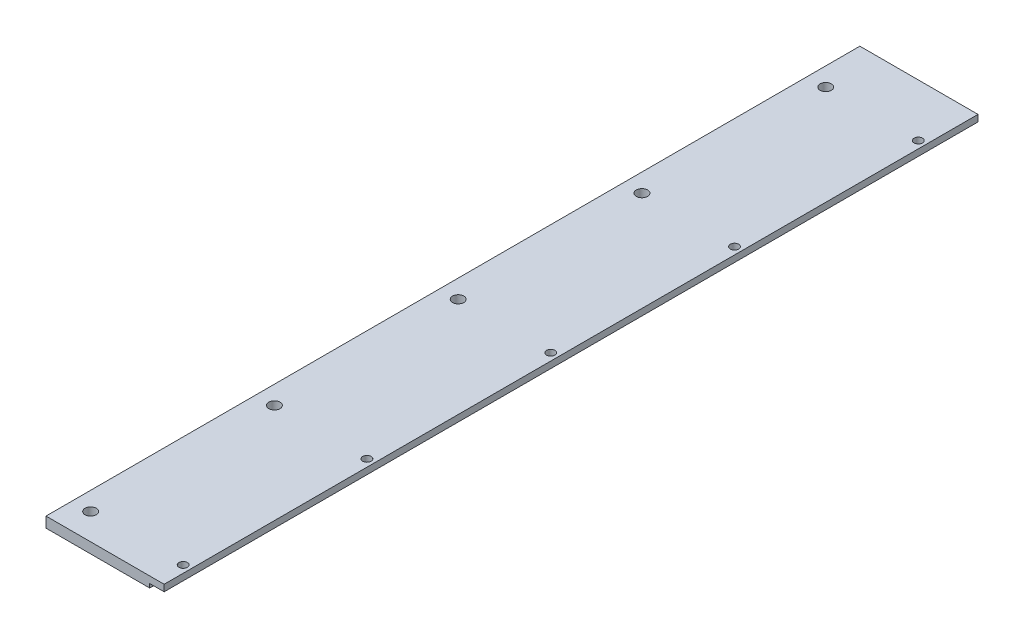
ISO-10303-21;
HEADER;
FILE_DESCRIPTION(('STEP AP214'),'2;1');
FILE_NAME('part.step','',(''),(''),'','','');
FILE_SCHEMA(('AUTOMOTIVE_DESIGN { 1 0 10303 214 1 1 1 1 }'));
ENDSEC;
DATA;
#1=APPLICATION_CONTEXT('core data for automotive mechanical design processes');
#2=APPLICATION_PROTOCOL_DEFINITION('international standard','automotive_design',2000,#1);
#3=PRODUCT_CONTEXT('',#1,'mechanical');
#4=PRODUCT('Part','Part','',(#3));
#5=PRODUCT_RELATED_PRODUCT_CATEGORY('part','',(#4));
#6=PRODUCT_DEFINITION_FORMATION('','',#4);
#7=PRODUCT_DEFINITION_CONTEXT('part definition',#1,'design');
#8=PRODUCT_DEFINITION('design','',#6,#7);
#9=PRODUCT_DEFINITION_SHAPE('','',#8);
#10=(LENGTH_UNIT() NAMED_UNIT(*) SI_UNIT(.MILLI.,.METRE.));
#11=(NAMED_UNIT(*) PLANE_ANGLE_UNIT() SI_UNIT($,.RADIAN.));
#12=(NAMED_UNIT(*) SI_UNIT($,.STERADIAN.) SOLID_ANGLE_UNIT());
#13=UNCERTAINTY_MEASURE_WITH_UNIT(LENGTH_MEASURE(1.E-05),#10,'distance_accuracy_value','');
#14=(GEOMETRIC_REPRESENTATION_CONTEXT(3) GLOBAL_UNCERTAINTY_ASSIGNED_CONTEXT((#13)) GLOBAL_UNIT_ASSIGNED_CONTEXT((#10,
#11,#12)) REPRESENTATION_CONTEXT('',''));
#15=CARTESIAN_POINT('',(0.,0.,0.));
#16=DIRECTION('',(0.,0.,1.));
#17=DIRECTION('',(1.,0.,0.));
#18=AXIS2_PLACEMENT_3D('',#15,#16,#17);
#19=CARTESIAN_POINT('',(0.,0.,310.));
#20=DIRECTION('',(1.,0.,0.));
#21=DIRECTION('',(0.,0.,-1.));
#22=AXIS2_PLACEMENT_3D('',#19,#20,#21);
#23=PLANE('',#22);
#24=DIRECTION('',(0.,-1.,0.));
#25=VECTOR('',#24,1.);
#26=CARTESIAN_POINT('',(0.,0.,0.));
#27=LINE('',#26,#25);
#28=CARTESIAN_POINT('',(0.,4.,0.));
#29=VERTEX_POINT('',#28);
#30=CARTESIAN_POINT('',(0.,0.,0.));
#31=VERTEX_POINT('',#30);
#32=EDGE_CURVE('E406',#29,#31,#27,.T.);
#33=ORIENTED_EDGE('',*,*,#32,.T.);
#34=DIRECTION('',(0.,0.,-1.));
#35=VECTOR('',#34,1.);
#36=CARTESIAN_POINT('',(0.,0.,310.));
#37=LINE('',#36,#35);
#38=CARTESIAN_POINT('',(0.,0.,310.));
#39=VERTEX_POINT('',#38);
#40=EDGE_CURVE('E11',#39,#31,#37,.T.);
#41=ORIENTED_EDGE('',*,*,#40,.F.);
#42=DIRECTION('',(0.,-1.,0.));
#43=VECTOR('',#42,1.);
#44=CARTESIAN_POINT('',(0.,0.,310.));
#45=LINE('',#44,#43);
#46=CARTESIAN_POINT('',(0.,4.,310.));
#47=VERTEX_POINT('',#46);
#48=EDGE_CURVE('E434',#47,#39,#45,.T.);
#49=ORIENTED_EDGE('',*,*,#48,.F.);
#50=DIRECTION('',(0.,0.,-1.));
#51=VECTOR('',#50,1.);
#52=CARTESIAN_POINT('',(0.,4.,310.));
#53=LINE('',#52,#51);
#54=EDGE_CURVE('E419',#47,#29,#53,.T.);
#55=ORIENTED_EDGE('',*,*,#54,.T.);
#56=EDGE_LOOP('',(#33,#41,#49,#55));
#57=FACE_BOUND('',#56,.T.);
#58=ADVANCED_FACE('F348',(#57),#23,.F.);
#59=CARTESIAN_POINT('',(0.,0.,310.));
#60=DIRECTION('',(0.,1.,0.));
#61=DIRECTION('',(0.,0.,1.));
#62=AXIS2_PLACEMENT_3D('',#59,#60,#61);
#63=PLANE('',#62);
#64=CARTESIAN_POINT('',(7.00000000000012,0.,20.0000000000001));
#65=DIRECTION('',(0.,1.,0.));
#66=DIRECTION('',(0.,0.,1.));
#67=AXIS2_PLACEMENT_3D('',#64,#65,#66);
#68=CIRCLE('',#67,2.15);
#69=CARTESIAN_POINT('',(7.00000000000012,0.,22.1500000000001));
#70=VERTEX_POINT('',#69);
#71=EDGE_CURVE('E485',#70,#70,#68,.T.);
#72=ORIENTED_EDGE('',*,*,#71,.T.);
#73=EDGE_LOOP('',(#72));
#74=FACE_BOUND('',#73,.T.);
#75=CARTESIAN_POINT('',(7.00000000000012,0.,90.0000000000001));
#76=DIRECTION('',(0.,1.,0.));
#77=DIRECTION('',(0.,0.,1.));
#78=AXIS2_PLACEMENT_3D('',#75,#76,#77);
#79=CIRCLE('',#78,2.15);
#80=CARTESIAN_POINT('',(7.00000000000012,0.,92.1500000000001));
#81=VERTEX_POINT('',#80);
#82=EDGE_CURVE('E491',#81,#81,#79,.T.);
#83=ORIENTED_EDGE('',*,*,#82,.T.);
#84=EDGE_LOOP('',(#83));
#85=FACE_BOUND('',#84,.T.);
#86=CARTESIAN_POINT('',(7.00000000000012,0.,160.));
#87=DIRECTION('',(0.,1.,0.));
#88=DIRECTION('',(0.,0.,1.));
#89=AXIS2_PLACEMENT_3D('',#86,#87,#88);
#90=CIRCLE('',#89,2.15);
#91=CARTESIAN_POINT('',(7.00000000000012,0.,162.15));
#92=VERTEX_POINT('',#91);
#93=EDGE_CURVE('E497',#92,#92,#90,.T.);
#94=ORIENTED_EDGE('',*,*,#93,.T.);
#95=EDGE_LOOP('',(#94));
#96=FACE_BOUND('',#95,.T.);
#97=CARTESIAN_POINT('',(7.00000000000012,0.,230.));
#98=DIRECTION('',(0.,1.,0.));
#99=DIRECTION('',(0.,0.,1.));
#100=AXIS2_PLACEMENT_3D('',#97,#98,#99);
#101=CIRCLE('',#100,2.15);
#102=CARTESIAN_POINT('',(7.00000000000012,0.,232.15));
#103=VERTEX_POINT('',#102);
#104=EDGE_CURVE('E503',#103,#103,#101,.T.);
#105=ORIENTED_EDGE('',*,*,#104,.T.);
#106=EDGE_LOOP('',(#105));
#107=FACE_BOUND('',#106,.T.);
#108=CARTESIAN_POINT('',(7.00000000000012,0.,300.));
#109=DIRECTION('',(0.,1.,0.));
#110=DIRECTION('',(0.,0.,1.));
#111=AXIS2_PLACEMENT_3D('',#108,#109,#110);
#112=CIRCLE('',#111,2.15);
#113=CARTESIAN_POINT('',(7.00000000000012,0.,302.15));
#114=VERTEX_POINT('',#113);
#115=EDGE_CURVE('E420',#114,#114,#112,.T.);
#116=ORIENTED_EDGE('',*,*,#115,.T.);
#117=EDGE_LOOP('',(#116));
#118=FACE_BOUND('',#117,.T.);
#119=DIRECTION('',(1.,0.,0.));
#120=VECTOR('',#119,1.);
#121=CARTESIAN_POINT('',(0.,0.,0.));
#122=LINE('',#121,#120);
#123=CARTESIAN_POINT('',(39.5,0.,0.));
#124=VERTEX_POINT('',#123);
#125=EDGE_CURVE('E402',#31,#124,#122,.T.);
#126=ORIENTED_EDGE('',*,*,#125,.T.);
#127=DIRECTION('',(0.,0.,-1.));
#128=VECTOR('',#127,1.);
#129=CARTESIAN_POINT('',(39.5,0.,310.));
#130=LINE('',#129,#128);
#131=CARTESIAN_POINT('',(39.5,0.,310.));
#132=VERTEX_POINT('',#131);
#133=EDGE_CURVE('E356',#132,#124,#130,.T.);
#134=ORIENTED_EDGE('',*,*,#133,.F.);
#135=DIRECTION('',(1.,0.,0.));
#136=VECTOR('',#135,1.);
#137=CARTESIAN_POINT('',(0.,0.,310.));
#138=LINE('',#137,#136);
#139=EDGE_CURVE('E415',#39,#132,#138,.T.);
#140=ORIENTED_EDGE('',*,*,#139,.F.);
#141=ORIENTED_EDGE('',*,*,#40,.T.);
#142=EDGE_LOOP('',(#126,#134,#140,#141));
#143=FACE_BOUND('',#142,.T.);
#144=ADVANCED_FACE('F414',(#74,#85,#96,#107,#118,#143),#63,.F.);
#145=CARTESIAN_POINT('',(39.5,1.5,310.));
#146=DIRECTION('',(-1.,0.,0.));
#147=DIRECTION('',(0.,-1.,0.));
#148=AXIS2_PLACEMENT_3D('',#145,#146,#147);
#149=PLANE('',#148);
#150=DIRECTION('',(0.,1.,0.));
#151=VECTOR('',#150,1.);
#152=CARTESIAN_POINT('',(39.5,1.5,0.));
#153=LINE('',#152,#151);
#154=CARTESIAN_POINT('',(39.5,1.5,0.));
#155=VERTEX_POINT('',#154);
#156=EDGE_CURVE('E408',#124,#155,#153,.T.);
#157=ORIENTED_EDGE('',*,*,#156,.T.);
#158=DIRECTION('',(0.,0.,-1.));
#159=VECTOR('',#158,1.);
#160=CARTESIAN_POINT('',(39.5,1.5,310.));
#161=LINE('',#160,#159);
#162=CARTESIAN_POINT('',(39.5,1.5,310.));
#163=VERTEX_POINT('',#162);
#164=EDGE_CURVE('E450',#163,#155,#161,.T.);
#165=ORIENTED_EDGE('',*,*,#164,.F.);
#166=DIRECTION('',(0.,1.,0.));
#167=VECTOR('',#166,1.);
#168=CARTESIAN_POINT('',(39.5,1.5,310.));
#169=LINE('',#168,#167);
#170=EDGE_CURVE('E437',#132,#163,#169,.T.);
#171=ORIENTED_EDGE('',*,*,#170,.F.);
#172=ORIENTED_EDGE('',*,*,#133,.T.);
#173=EDGE_LOOP('',(#157,#165,#171,#172));
#174=FACE_BOUND('',#173,.T.);
#175=ADVANCED_FACE('F528',(#174),#149,.F.);
#176=CARTESIAN_POINT('',(39.5,1.5,310.));
#177=DIRECTION('',(0.,1.,0.));
#178=DIRECTION('',(0.,0.,1.));
#179=AXIS2_PLACEMENT_3D('',#176,#177,#178);
#180=PLANE('',#179);
#181=CARTESIAN_POINT('',(42.25,1.5,20.0000000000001));
#182=DIRECTION('',(0.,1.,0.));
#183=DIRECTION('',(0.,0.,1.));
#184=AXIS2_PLACEMENT_3D('',#181,#182,#183);
#185=CIRCLE('',#184,1.59999999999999);
#186=CARTESIAN_POINT('',(42.25,1.5,21.6000000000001));
#187=VERTEX_POINT('',#186);
#188=EDGE_CURVE('E351',#187,#187,#185,.T.);
#189=ORIENTED_EDGE('',*,*,#188,.T.);
#190=EDGE_LOOP('',(#189));
#191=FACE_BOUND('',#190,.T.);
#192=CARTESIAN_POINT('',(42.25,1.5,90.0000000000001));
#193=DIRECTION('',(0.,1.,0.));
#194=DIRECTION('',(0.,0.,1.));
#195=AXIS2_PLACEMENT_3D('',#192,#193,#194);
#196=CIRCLE('',#195,1.59999999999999);
#197=CARTESIAN_POINT('',(42.25,1.5,91.6000000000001));
#198=VERTEX_POINT('',#197);
#199=EDGE_CURVE('E466',#198,#198,#196,.T.);
#200=ORIENTED_EDGE('',*,*,#199,.T.);
#201=EDGE_LOOP('',(#200));
#202=FACE_BOUND('',#201,.T.);
#203=CARTESIAN_POINT('',(42.25,1.5,160.));
#204=DIRECTION('',(0.,1.,0.));
#205=DIRECTION('',(0.,0.,1.));
#206=AXIS2_PLACEMENT_3D('',#203,#204,#205);
#207=CIRCLE('',#206,1.59999999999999);
#208=CARTESIAN_POINT('',(42.25,1.5,161.6));
#209=VERTEX_POINT('',#208);
#210=EDGE_CURVE('E463',#209,#209,#207,.T.);
#211=ORIENTED_EDGE('',*,*,#210,.T.);
#212=EDGE_LOOP('',(#211));
#213=FACE_BOUND('',#212,.T.);
#214=CARTESIAN_POINT('',(42.25,1.5,230.));
#215=DIRECTION('',(0.,1.,0.));
#216=DIRECTION('',(0.,0.,1.));
#217=AXIS2_PLACEMENT_3D('',#214,#215,#216);
#218=CIRCLE('',#217,1.59999999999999);
#219=CARTESIAN_POINT('',(42.25,1.5,231.6));
#220=VERTEX_POINT('',#219);
#221=EDGE_CURVE('E458',#220,#220,#218,.T.);
#222=ORIENTED_EDGE('',*,*,#221,.T.);
#223=EDGE_LOOP('',(#222));
#224=FACE_BOUND('',#223,.T.);
#225=CARTESIAN_POINT('',(42.25,1.5,300.));
#226=DIRECTION('',(0.,1.,0.));
#227=DIRECTION('',(0.,0.,1.));
#228=AXIS2_PLACEMENT_3D('',#225,#226,#227);
#229=CIRCLE('',#228,1.59999999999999);
#230=CARTESIAN_POINT('',(42.25,1.5,301.6));
#231=VERTEX_POINT('',#230);
#232=EDGE_CURVE('E454',#231,#231,#229,.T.);
#233=ORIENTED_EDGE('',*,*,#232,.T.);
#234=EDGE_LOOP('',(#233));
#235=FACE_BOUND('',#234,.T.);
#236=DIRECTION('',(1.,0.,0.));
#237=VECTOR('',#236,1.);
#238=CARTESIAN_POINT('',(39.5,1.5,0.));
#239=LINE('',#238,#237);
#240=CARTESIAN_POINT('',(45.,1.5,0.));
#241=VERTEX_POINT('',#240);
#242=EDGE_CURVE('E428',#155,#241,#239,.T.);
#243=ORIENTED_EDGE('',*,*,#242,.T.);
#244=DIRECTION('',(0.,0.,-1.));
#245=VECTOR('',#244,1.);
#246=CARTESIAN_POINT('',(45.,1.5,310.));
#247=LINE('',#246,#245);
#248=CARTESIAN_POINT('',(45.,1.5,310.));
#249=VERTEX_POINT('',#248);
#250=EDGE_CURVE('E447',#249,#241,#247,.T.);
#251=ORIENTED_EDGE('',*,*,#250,.F.);
#252=DIRECTION('',(1.,0.,0.));
#253=VECTOR('',#252,1.);
#254=CARTESIAN_POINT('',(39.5,1.5,310.));
#255=LINE('',#254,#253);
#256=EDGE_CURVE('E439',#163,#249,#255,.T.);
#257=ORIENTED_EDGE('',*,*,#256,.F.);
#258=ORIENTED_EDGE('',*,*,#164,.T.);
#259=EDGE_LOOP('',(#243,#251,#257,#258));
#260=FACE_BOUND('',#259,.T.);
#261=ADVANCED_FACE('F524',(#191,#202,#213,#224,#235,#260),#180,.F.);
#262=CARTESIAN_POINT('',(45.,1.5,310.));
#263=DIRECTION('',(-1.,0.,0.));
#264=DIRECTION('',(0.,0.,1.));
#265=AXIS2_PLACEMENT_3D('',#262,#263,#264);
#266=PLANE('',#265);
#267=DIRECTION('',(0.,1.,0.));
#268=VECTOR('',#267,1.);
#269=CARTESIAN_POINT('',(45.,1.5,0.));
#270=LINE('',#269,#268);
#271=CARTESIAN_POINT('',(45.,4.,0.));
#272=VERTEX_POINT('',#271);
#273=EDGE_CURVE('E430',#241,#272,#270,.T.);
#274=ORIENTED_EDGE('',*,*,#273,.T.);
#275=DIRECTION('',(0.,0.,-1.));
#276=VECTOR('',#275,1.);
#277=CARTESIAN_POINT('',(45.,4.,310.));
#278=LINE('',#277,#276);
#279=CARTESIAN_POINT('',(45.,4.,310.));
#280=VERTEX_POINT('',#279);
#281=EDGE_CURVE('E444',#280,#272,#278,.T.);
#282=ORIENTED_EDGE('',*,*,#281,.F.);
#283=DIRECTION('',(0.,1.,0.));
#284=VECTOR('',#283,1.);
#285=CARTESIAN_POINT('',(45.,1.5,310.));
#286=LINE('',#285,#284);
#287=EDGE_CURVE('E369',#249,#280,#286,.T.);
#288=ORIENTED_EDGE('',*,*,#287,.F.);
#289=ORIENTED_EDGE('',*,*,#250,.T.);
#290=EDGE_LOOP('',(#274,#282,#288,#289));
#291=FACE_BOUND('',#290,.T.);
#292=ADVANCED_FACE('F516',(#291),#266,.F.);
#293=CARTESIAN_POINT('',(0.,4.,310.));
#294=DIRECTION('',(0.,-1.,0.));
#295=DIRECTION('',(0.,0.,-1.));
#296=AXIS2_PLACEMENT_3D('',#293,#294,#295);
#297=PLANE('',#296);
#298=CARTESIAN_POINT('',(42.25,4.,20.0000000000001));
#299=DIRECTION('',(0.,1.,0.));
#300=DIRECTION('',(0.,0.,1.));
#301=AXIS2_PLACEMENT_3D('',#298,#299,#300);
#302=CIRCLE('',#301,1.59999999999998);
#303=CARTESIAN_POINT('',(42.25,4.,21.6000000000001));
#304=VERTEX_POINT('',#303);
#305=EDGE_CURVE('E478',#304,#304,#302,.T.);
#306=ORIENTED_EDGE('',*,*,#305,.F.);
#307=EDGE_LOOP('',(#306));
#308=FACE_BOUND('',#307,.T.);
#309=CARTESIAN_POINT('',(42.25,4.,90.0000000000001));
#310=DIRECTION('',(0.,1.,0.));
#311=DIRECTION('',(0.,0.,1.));
#312=AXIS2_PLACEMENT_3D('',#309,#310,#311);
#313=CIRCLE('',#312,1.59999999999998);
#314=CARTESIAN_POINT('',(42.25,4.,91.6000000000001));
#315=VERTEX_POINT('',#314);
#316=EDGE_CURVE('E468',#315,#315,#313,.T.);
#317=ORIENTED_EDGE('',*,*,#316,.F.);
#318=EDGE_LOOP('',(#317));
#319=FACE_BOUND('',#318,.T.);
#320=CARTESIAN_POINT('',(42.25,4.,160.));
#321=DIRECTION('',(0.,1.,0.));
#322=DIRECTION('',(0.,0.,1.));
#323=AXIS2_PLACEMENT_3D('',#320,#321,#322);
#324=CIRCLE('',#323,1.59999999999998);
#325=CARTESIAN_POINT('',(42.25,4.,161.6));
#326=VERTEX_POINT('',#325);
#327=EDGE_CURVE('E465',#326,#326,#324,.T.);
#328=ORIENTED_EDGE('',*,*,#327,.F.);
#329=EDGE_LOOP('',(#328));
#330=FACE_BOUND('',#329,.T.);
#331=CARTESIAN_POINT('',(42.25,4.,230.));
#332=DIRECTION('',(0.,1.,0.));
#333=DIRECTION('',(0.,0.,1.));
#334=AXIS2_PLACEMENT_3D('',#331,#332,#333);
#335=CIRCLE('',#334,1.59999999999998);
#336=CARTESIAN_POINT('',(42.25,4.,231.6));
#337=VERTEX_POINT('',#336);
#338=EDGE_CURVE('E462',#337,#337,#335,.T.);
#339=ORIENTED_EDGE('',*,*,#338,.F.);
#340=EDGE_LOOP('',(#339));
#341=FACE_BOUND('',#340,.T.);
#342=CARTESIAN_POINT('',(7.00000000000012,4.,20.0000000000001));
#343=DIRECTION('',(0.,1.,0.));
#344=DIRECTION('',(0.,0.,1.));
#345=AXIS2_PLACEMENT_3D('',#342,#343,#344);
#346=CIRCLE('',#345,2.14999999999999);
#347=CARTESIAN_POINT('',(7.00000000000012,4.,22.1500000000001));
#348=VERTEX_POINT('',#347);
#349=EDGE_CURVE('E461',#348,#348,#346,.T.);
#350=ORIENTED_EDGE('',*,*,#349,.F.);
#351=EDGE_LOOP('',(#350));
#352=FACE_BOUND('',#351,.T.);
#353=CARTESIAN_POINT('',(7.00000000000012,4.,90.0000000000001));
#354=DIRECTION('',(0.,1.,0.));
#355=DIRECTION('',(0.,0.,1.));
#356=AXIS2_PLACEMENT_3D('',#353,#354,#355);
#357=CIRCLE('',#356,2.14999999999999);
#358=CARTESIAN_POINT('',(7.00000000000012,4.,92.1500000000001));
#359=VERTEX_POINT('',#358);
#360=EDGE_CURVE('E488',#359,#359,#357,.T.);
#361=ORIENTED_EDGE('',*,*,#360,.F.);
#362=EDGE_LOOP('',(#361));
#363=FACE_BOUND('',#362,.T.);
#364=CARTESIAN_POINT('',(7.00000000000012,4.,160.));
#365=DIRECTION('',(0.,1.,0.));
#366=DIRECTION('',(0.,0.,1.));
#367=AXIS2_PLACEMENT_3D('',#364,#365,#366);
#368=CIRCLE('',#367,2.14999999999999);
#369=CARTESIAN_POINT('',(7.00000000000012,4.,162.15));
#370=VERTEX_POINT('',#369);
#371=EDGE_CURVE('E494',#370,#370,#368,.T.);
#372=ORIENTED_EDGE('',*,*,#371,.F.);
#373=EDGE_LOOP('',(#372));
#374=FACE_BOUND('',#373,.T.);
#375=CARTESIAN_POINT('',(7.00000000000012,4.,230.));
#376=DIRECTION('',(0.,1.,0.));
#377=DIRECTION('',(0.,0.,1.));
#378=AXIS2_PLACEMENT_3D('',#375,#376,#377);
#379=CIRCLE('',#378,2.14999999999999);
#380=CARTESIAN_POINT('',(7.00000000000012,4.,232.15));
#381=VERTEX_POINT('',#380);
#382=EDGE_CURVE('E500',#381,#381,#379,.T.);
#383=ORIENTED_EDGE('',*,*,#382,.F.);
#384=EDGE_LOOP('',(#383));
#385=FACE_BOUND('',#384,.T.);
#386=CARTESIAN_POINT('',(42.25,4.,300.));
#387=DIRECTION('',(0.,1.,0.));
#388=DIRECTION('',(0.,0.,1.));
#389=AXIS2_PLACEMENT_3D('',#386,#387,#388);
#390=CIRCLE('',#389,1.59999999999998);
#391=CARTESIAN_POINT('',(42.25,4.,301.6));
#392=VERTEX_POINT('',#391);
#393=EDGE_CURVE('E457',#392,#392,#390,.T.);
#394=ORIENTED_EDGE('',*,*,#393,.F.);
#395=EDGE_LOOP('',(#394));
#396=FACE_BOUND('',#395,.T.);
#397=CARTESIAN_POINT('',(7.00000000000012,4.,300.));
#398=DIRECTION('',(0.,1.,0.));
#399=DIRECTION('',(0.,0.,1.));
#400=AXIS2_PLACEMENT_3D('',#397,#398,#399);
#401=CIRCLE('',#400,2.14999999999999);
#402=CARTESIAN_POINT('',(7.00000000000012,4.,302.15));
#403=VERTEX_POINT('',#402);
#404=EDGE_CURVE('E423',#403,#403,#401,.T.);
#405=ORIENTED_EDGE('',*,*,#404,.F.);
#406=EDGE_LOOP('',(#405));
#407=FACE_BOUND('',#406,.T.);
#408=DIRECTION('',(-1.,0.,0.));
#409=VECTOR('',#408,1.);
#410=CARTESIAN_POINT('',(0.,4.,0.));
#411=LINE('',#410,#409);
#412=EDGE_CURVE('E432',#272,#29,#411,.T.);
#413=ORIENTED_EDGE('',*,*,#412,.T.);
#414=ORIENTED_EDGE('',*,*,#54,.F.);
#415=DIRECTION('',(-1.,0.,0.));
#416=VECTOR('',#415,1.);
#417=CARTESIAN_POINT('',(0.,4.,310.));
#418=LINE('',#417,#416);
#419=EDGE_CURVE('E364',#280,#47,#418,.T.);
#420=ORIENTED_EDGE('',*,*,#419,.F.);
#421=ORIENTED_EDGE('',*,*,#281,.T.);
#422=EDGE_LOOP('',(#413,#414,#420,#421));
#423=FACE_BOUND('',#422,.T.);
#424=ADVANCED_FACE('F512',(#308,#319,#330,#341,#352,#363,#374,#385,#396,#407,#423),#297,.F.);
#425=CARTESIAN_POINT('',(0.,4.,310.));
#426=DIRECTION('',(0.,0.,-1.));
#427=DIRECTION('',(-1.,0.,0.));
#428=AXIS2_PLACEMENT_3D('',#425,#426,#427);
#429=PLANE('',#428);
#430=ORIENTED_EDGE('',*,*,#48,.T.);
#431=ORIENTED_EDGE('',*,*,#139,.T.);
#432=ORIENTED_EDGE('',*,*,#170,.T.);
#433=ORIENTED_EDGE('',*,*,#256,.T.);
#434=ORIENTED_EDGE('',*,*,#287,.T.);
#435=ORIENTED_EDGE('',*,*,#419,.T.);
#436=EDGE_LOOP('',(#430,#431,#432,#433,#434,#435));
#437=FACE_BOUND('',#436,.T.);
#438=ADVANCED_FACE('F515',(#437),#429,.F.);
#439=CARTESIAN_POINT('',(0.,4.,0.));
#440=DIRECTION('',(0.,0.,-1.));
#441=DIRECTION('',(-1.,0.,0.));
#442=AXIS2_PLACEMENT_3D('',#439,#440,#441);
#443=PLANE('',#442);
#444=ORIENTED_EDGE('',*,*,#32,.F.);
#445=ORIENTED_EDGE('',*,*,#412,.F.);
#446=ORIENTED_EDGE('',*,*,#273,.F.);
#447=ORIENTED_EDGE('',*,*,#242,.F.);
#448=ORIENTED_EDGE('',*,*,#156,.F.);
#449=ORIENTED_EDGE('',*,*,#125,.F.);
#450=EDGE_LOOP('',(#444,#445,#446,#447,#448,#449));
#451=FACE_BOUND('',#450,.T.);
#452=ADVANCED_FACE('F403',(#451),#443,.T.);
#453=CARTESIAN_POINT('',(7.00000000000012,4.,300.));
#454=DIRECTION('',(0.,1.,0.));
#455=DIRECTION('',(0.,0.,1.));
#456=AXIS2_PLACEMENT_3D('',#453,#454,#455);
#457=CYLINDRICAL_SURFACE('',#456,2.14999999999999);
#458=ORIENTED_EDGE('',*,*,#115,.F.);
#459=EDGE_LOOP('',(#458));
#460=FACE_BOUND('',#459,.T.);
#461=ORIENTED_EDGE('',*,*,#404,.T.);
#462=EDGE_LOOP('',(#461));
#463=FACE_BOUND('',#462,.T.);
#464=ADVANCED_FACE('F510',(#460,#463),#457,.F.);
#465=CARTESIAN_POINT('',(42.25,4.,300.));
#466=DIRECTION('',(0.,1.,0.));
#467=DIRECTION('',(0.,0.,1.));
#468=AXIS2_PLACEMENT_3D('',#465,#466,#467);
#469=CYLINDRICAL_SURFACE('',#468,1.59999999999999);
#470=ORIENTED_EDGE('',*,*,#393,.T.);
#471=EDGE_LOOP('',(#470));
#472=FACE_BOUND('',#471,.T.);
#473=ORIENTED_EDGE('',*,*,#232,.F.);
#474=EDGE_LOOP('',(#473));
#475=FACE_BOUND('',#474,.T.);
#476=ADVANCED_FACE('F566',(#472,#475),#469,.F.);
#477=CARTESIAN_POINT('',(7.00000000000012,4.,230.));
#478=DIRECTION('',(0.,1.,0.));
#479=DIRECTION('',(0.,0.,1.));
#480=AXIS2_PLACEMENT_3D('',#477,#478,#479);
#481=CYLINDRICAL_SURFACE('',#480,2.14999999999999);
#482=ORIENTED_EDGE('',*,*,#104,.F.);
#483=EDGE_LOOP('',(#482));
#484=FACE_BOUND('',#483,.T.);
#485=ORIENTED_EDGE('',*,*,#382,.T.);
#486=EDGE_LOOP('',(#485));
#487=FACE_BOUND('',#486,.T.);
#488=ADVANCED_FACE('F568',(#484,#487),#481,.F.);
#489=CARTESIAN_POINT('',(7.00000000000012,4.,160.));
#490=DIRECTION('',(0.,1.,0.));
#491=DIRECTION('',(0.,0.,1.));
#492=AXIS2_PLACEMENT_3D('',#489,#490,#491);
#493=CYLINDRICAL_SURFACE('',#492,2.14999999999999);
#494=ORIENTED_EDGE('',*,*,#93,.F.);
#495=EDGE_LOOP('',(#494));
#496=FACE_BOUND('',#495,.T.);
#497=ORIENTED_EDGE('',*,*,#371,.T.);
#498=EDGE_LOOP('',(#497));
#499=FACE_BOUND('',#498,.T.);
#500=ADVANCED_FACE('F575',(#496,#499),#493,.F.);
#501=CARTESIAN_POINT('',(7.00000000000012,4.,90.0000000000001));
#502=DIRECTION('',(0.,1.,0.));
#503=DIRECTION('',(0.,0.,1.));
#504=AXIS2_PLACEMENT_3D('',#501,#502,#503);
#505=CYLINDRICAL_SURFACE('',#504,2.14999999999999);
#506=ORIENTED_EDGE('',*,*,#82,.F.);
#507=EDGE_LOOP('',(#506));
#508=FACE_BOUND('',#507,.T.);
#509=ORIENTED_EDGE('',*,*,#360,.T.);
#510=EDGE_LOOP('',(#509));
#511=FACE_BOUND('',#510,.T.);
#512=ADVANCED_FACE('F583',(#508,#511),#505,.F.);
#513=CARTESIAN_POINT('',(7.00000000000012,4.,20.0000000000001));
#514=DIRECTION('',(0.,1.,0.));
#515=DIRECTION('',(0.,0.,1.));
#516=AXIS2_PLACEMENT_3D('',#513,#514,#515);
#517=CYLINDRICAL_SURFACE('',#516,2.14999999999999);
#518=ORIENTED_EDGE('',*,*,#71,.F.);
#519=EDGE_LOOP('',(#518));
#520=FACE_BOUND('',#519,.T.);
#521=ORIENTED_EDGE('',*,*,#349,.T.);
#522=EDGE_LOOP('',(#521));
#523=FACE_BOUND('',#522,.T.);
#524=ADVANCED_FACE('F587',(#520,#523),#517,.F.);
#525=CARTESIAN_POINT('',(42.25,4.,230.));
#526=DIRECTION('',(0.,1.,0.));
#527=DIRECTION('',(0.,0.,1.));
#528=AXIS2_PLACEMENT_3D('',#525,#526,#527);
#529=CYLINDRICAL_SURFACE('',#528,1.59999999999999);
#530=ORIENTED_EDGE('',*,*,#338,.T.);
#531=EDGE_LOOP('',(#530));
#532=FACE_BOUND('',#531,.T.);
#533=ORIENTED_EDGE('',*,*,#221,.F.);
#534=EDGE_LOOP('',(#533));
#535=FACE_BOUND('',#534,.T.);
#536=ADVANCED_FACE('F591',(#532,#535),#529,.F.);
#537=CARTESIAN_POINT('',(42.25,4.,160.));
#538=DIRECTION('',(0.,1.,0.));
#539=DIRECTION('',(0.,0.,1.));
#540=AXIS2_PLACEMENT_3D('',#537,#538,#539);
#541=CYLINDRICAL_SURFACE('',#540,1.59999999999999);
#542=ORIENTED_EDGE('',*,*,#327,.T.);
#543=EDGE_LOOP('',(#542));
#544=FACE_BOUND('',#543,.T.);
#545=ORIENTED_EDGE('',*,*,#210,.F.);
#546=EDGE_LOOP('',(#545));
#547=FACE_BOUND('',#546,.T.);
#548=ADVANCED_FACE('F595',(#544,#547),#541,.F.);
#549=CARTESIAN_POINT('',(42.25,4.,90.0000000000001));
#550=DIRECTION('',(0.,1.,0.));
#551=DIRECTION('',(0.,0.,1.));
#552=AXIS2_PLACEMENT_3D('',#549,#550,#551);
#553=CYLINDRICAL_SURFACE('',#552,1.59999999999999);
#554=ORIENTED_EDGE('',*,*,#316,.T.);
#555=EDGE_LOOP('',(#554));
#556=FACE_BOUND('',#555,.T.);
#557=ORIENTED_EDGE('',*,*,#199,.F.);
#558=EDGE_LOOP('',(#557));
#559=FACE_BOUND('',#558,.T.);
#560=ADVANCED_FACE('F599',(#556,#559),#553,.F.);
#561=CARTESIAN_POINT('',(42.25,4.,20.0000000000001));
#562=DIRECTION('',(0.,1.,0.));
#563=DIRECTION('',(0.,0.,1.));
#564=AXIS2_PLACEMENT_3D('',#561,#562,#563);
#565=CYLINDRICAL_SURFACE('',#564,1.59999999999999);
#566=ORIENTED_EDGE('',*,*,#305,.T.);
#567=EDGE_LOOP('',(#566));
#568=FACE_BOUND('',#567,.T.);
#569=ORIENTED_EDGE('',*,*,#188,.F.);
#570=EDGE_LOOP('',(#569));
#571=FACE_BOUND('',#570,.T.);
#572=ADVANCED_FACE('F603',(#568,#571),#565,.F.);
#573=CLOSED_SHELL('',(#58,#144,#175,#261,#292,#424,#438,#452,#464,#476,#488,#500,#512,#524,#536,
#548,#560,#572));
#574=MANIFOLD_SOLID_BREP('B2',#573);
#575=ADVANCED_BREP_SHAPE_REPRESENTATION('',(#18,#574),#14);
#576=SHAPE_DEFINITION_REPRESENTATION(#9,#575);
ENDSEC;
END-ISO-10303-21;
